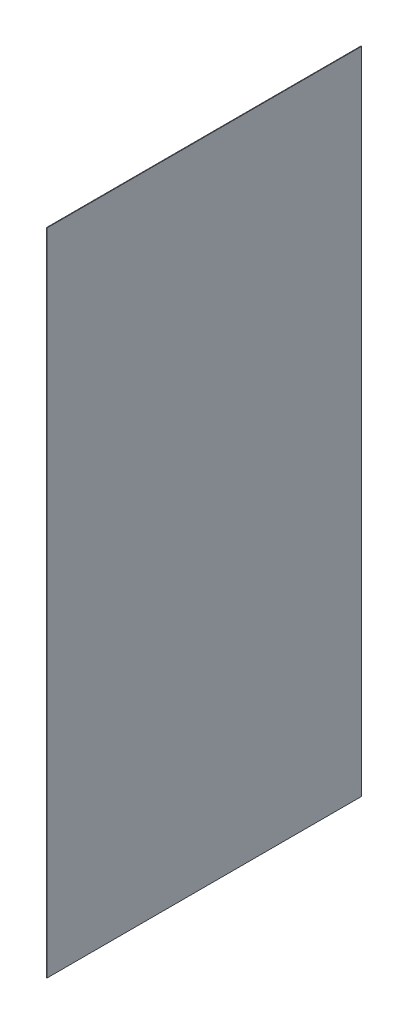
ISO-10303-21;
HEADER;
FILE_DESCRIPTION(('STEP AP214'),'2;1');
FILE_NAME('part.step','',(''),(''),'','','');
FILE_SCHEMA(('AUTOMOTIVE_DESIGN { 1 0 10303 214 1 1 1 1 }'));
ENDSEC;
DATA;
#1=APPLICATION_CONTEXT('core data for automotive mechanical design processes');
#2=APPLICATION_PROTOCOL_DEFINITION('international standard','automotive_design',2000,#1);
#3=PRODUCT_CONTEXT('',#1,'mechanical');
#4=PRODUCT('Part','Part','',(#3));
#5=PRODUCT_RELATED_PRODUCT_CATEGORY('part','',(#4));
#6=PRODUCT_DEFINITION_FORMATION('','',#4);
#7=PRODUCT_DEFINITION_CONTEXT('part definition',#1,'design');
#8=PRODUCT_DEFINITION('design','',#6,#7);
#9=PRODUCT_DEFINITION_SHAPE('','',#8);
#10=(LENGTH_UNIT() NAMED_UNIT(*) SI_UNIT(.MILLI.,.METRE.));
#11=(NAMED_UNIT(*) PLANE_ANGLE_UNIT() SI_UNIT($,.RADIAN.));
#12=(NAMED_UNIT(*) SI_UNIT($,.STERADIAN.) SOLID_ANGLE_UNIT());
#13=UNCERTAINTY_MEASURE_WITH_UNIT(LENGTH_MEASURE(1.E-05),#10,'distance_accuracy_value','');
#14=(GEOMETRIC_REPRESENTATION_CONTEXT(3) GLOBAL_UNCERTAINTY_ASSIGNED_CONTEXT((#13)) GLOBAL_UNIT_ASSIGNED_CONTEXT((#10,
#11,#12)) REPRESENTATION_CONTEXT('',''));
#15=CARTESIAN_POINT('',(0.,0.,0.));
#16=DIRECTION('',(0.,0.,1.));
#17=DIRECTION('',(1.,0.,0.));
#18=AXIS2_PLACEMENT_3D('',#15,#16,#17);
#19=CARTESIAN_POINT('',(0.,3504.13943968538,-1687.98786277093));
#20=DIRECTION('',(0.,1.,0.));
#21=DIRECTION('',(0.,0.,1.));
#22=AXIS2_PLACEMENT_3D('',#19,#20,#21);
#23=PLANE('',#22);
#24=DIRECTION('',(0.,0.,1.));
#25=VECTOR('',#24,1.);
#26=CARTESIAN_POINT('',(3.175,3504.13943968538,-1687.98786277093));
#27=LINE('',#26,#25);
#28=CARTESIAN_POINT('',(3.175,3504.13943968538,-1687.98786277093));
#29=VERTEX_POINT('',#28);
#30=CARTESIAN_POINT('',(3.175,3504.13943968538,32.862137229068));
#31=VERTEX_POINT('',#30);
#32=EDGE_CURVE('E95',#29,#31,#27,.T.);
#33=ORIENTED_EDGE('',*,*,#32,.F.);
#34=DIRECTION('',(1.,0.,0.));
#35=VECTOR('',#34,1.);
#36=CARTESIAN_POINT('',(0.,3504.13943968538,-1687.98786277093));
#37=LINE('',#36,#35);
#38=CARTESIAN_POINT('',(0.,3504.13943968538,-1687.98786277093));
#39=VERTEX_POINT('',#38);
#40=EDGE_CURVE('E11',#39,#29,#37,.T.);
#41=ORIENTED_EDGE('',*,*,#40,.F.);
#42=DIRECTION('',(0.,0.,1.));
#43=VECTOR('',#42,1.);
#44=CARTESIAN_POINT('',(0.,3504.13943968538,-1687.98786277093));
#45=LINE('',#44,#43);
#46=CARTESIAN_POINT('',(0.,3504.13943968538,32.862137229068));
#47=VERTEX_POINT('',#46);
#48=EDGE_CURVE('E89',#39,#47,#45,.T.);
#49=ORIENTED_EDGE('',*,*,#48,.T.);
#50=DIRECTION('',(1.,0.,0.));
#51=VECTOR('',#50,1.);
#52=CARTESIAN_POINT('',(0.,3504.13943968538,32.862137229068));
#53=LINE('',#52,#51);
#54=EDGE_CURVE('E34',#47,#31,#53,.T.);
#55=ORIENTED_EDGE('',*,*,#54,.T.);
#56=EDGE_LOOP('',(#33,#41,#49,#55));
#57=FACE_BOUND('',#56,.T.);
#58=ADVANCED_FACE('F31',(#57),#23,.T.);
#59=CARTESIAN_POINT('',(0.,-51.8605603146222,-1687.98786277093));
#60=DIRECTION('',(0.,0.,-1.));
#61=DIRECTION('',(0.,1.,0.));
#62=AXIS2_PLACEMENT_3D('',#59,#60,#61);
#63=PLANE('',#62);
#64=DIRECTION('',(0.,1.,0.));
#65=VECTOR('',#64,1.);
#66=CARTESIAN_POINT('',(3.175,-51.8605603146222,-1687.98786277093));
#67=LINE('',#66,#65);
#68=CARTESIAN_POINT('',(3.175,-51.8605603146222,-1687.98786277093));
#69=VERTEX_POINT('',#68);
#70=EDGE_CURVE('E91',#69,#29,#67,.T.);
#71=ORIENTED_EDGE('',*,*,#70,.F.);
#72=DIRECTION('',(1.,0.,0.));
#73=VECTOR('',#72,1.);
#74=CARTESIAN_POINT('',(0.,-51.8605603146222,-1687.98786277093));
#75=LINE('',#74,#73);
#76=CARTESIAN_POINT('',(0.,-51.8605603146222,-1687.98786277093));
#77=VERTEX_POINT('',#76);
#78=EDGE_CURVE('E40',#77,#69,#75,.T.);
#79=ORIENTED_EDGE('',*,*,#78,.F.);
#80=DIRECTION('',(0.,1.,0.));
#81=VECTOR('',#80,1.);
#82=CARTESIAN_POINT('',(0.,-51.8605603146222,-1687.98786277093));
#83=LINE('',#82,#81);
#84=EDGE_CURVE('E86',#77,#39,#83,.T.);
#85=ORIENTED_EDGE('',*,*,#84,.T.);
#86=ORIENTED_EDGE('',*,*,#40,.T.);
#87=EDGE_LOOP('',(#71,#79,#85,#86));
#88=FACE_BOUND('',#87,.T.);
#89=ADVANCED_FACE('F105',(#88),#63,.T.);
#90=CARTESIAN_POINT('',(0.,-51.8605603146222,32.8621372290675));
#91=DIRECTION('',(0.,-1.,0.));
#92=DIRECTION('',(0.,0.,-1.));
#93=AXIS2_PLACEMENT_3D('',#90,#91,#92);
#94=PLANE('',#93);
#95=DIRECTION('',(0.,0.,-1.));
#96=VECTOR('',#95,1.);
#97=CARTESIAN_POINT('',(3.175,-51.8605603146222,32.8621372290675));
#98=LINE('',#97,#96);
#99=CARTESIAN_POINT('',(3.175,-51.8605603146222,32.8621372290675));
#100=VERTEX_POINT('',#99);
#101=EDGE_CURVE('E81',#100,#69,#98,.T.);
#102=ORIENTED_EDGE('',*,*,#101,.F.);
#103=DIRECTION('',(1.,0.,0.));
#104=VECTOR('',#103,1.);
#105=CARTESIAN_POINT('',(0.,-51.8605603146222,32.8621372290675));
#106=LINE('',#105,#104);
#107=CARTESIAN_POINT('',(0.,-51.8605603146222,32.8621372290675));
#108=VERTEX_POINT('',#107);
#109=EDGE_CURVE('E76',#108,#100,#106,.T.);
#110=ORIENTED_EDGE('',*,*,#109,.F.);
#111=DIRECTION('',(0.,0.,-1.));
#112=VECTOR('',#111,1.);
#113=CARTESIAN_POINT('',(0.,-51.8605603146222,32.8621372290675));
#114=LINE('',#113,#112);
#115=EDGE_CURVE('E79',#108,#77,#114,.T.);
#116=ORIENTED_EDGE('',*,*,#115,.T.);
#117=ORIENTED_EDGE('',*,*,#78,.T.);
#118=EDGE_LOOP('',(#102,#110,#116,#117));
#119=FACE_BOUND('',#118,.T.);
#120=ADVANCED_FACE('F78',(#119),#94,.T.);
#121=CARTESIAN_POINT('',(0.,3504.13943968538,32.862137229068));
#122=DIRECTION('',(0.,0.,1.));
#123=DIRECTION('',(0.,-1.,0.));
#124=AXIS2_PLACEMENT_3D('',#121,#122,#123);
#125=PLANE('',#124);
#126=DIRECTION('',(0.,-1.,0.));
#127=VECTOR('',#126,1.);
#128=CARTESIAN_POINT('',(3.175,3504.13943968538,32.862137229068));
#129=LINE('',#128,#127);
#130=EDGE_CURVE('E98',#31,#100,#129,.T.);
#131=ORIENTED_EDGE('',*,*,#130,.F.);
#132=ORIENTED_EDGE('',*,*,#54,.F.);
#133=DIRECTION('',(0.,-1.,0.));
#134=VECTOR('',#133,1.);
#135=CARTESIAN_POINT('',(0.,3504.13943968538,32.862137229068));
#136=LINE('',#135,#134);
#137=EDGE_CURVE('E85',#47,#108,#136,.T.);
#138=ORIENTED_EDGE('',*,*,#137,.T.);
#139=ORIENTED_EDGE('',*,*,#109,.T.);
#140=EDGE_LOOP('',(#131,#132,#138,#139));
#141=FACE_BOUND('',#140,.T.);
#142=ADVANCED_FACE('F88',(#141),#125,.T.);
#143=CARTESIAN_POINT('',(0.,3504.13943968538,32.862137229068));
#144=DIRECTION('',(1.,0.,0.));
#145=DIRECTION('',(0.,0.,-1.));
#146=AXIS2_PLACEMENT_3D('',#143,#144,#145);
#147=PLANE('',#146);
#148=ORIENTED_EDGE('',*,*,#48,.F.);
#149=ORIENTED_EDGE('',*,*,#84,.F.);
#150=ORIENTED_EDGE('',*,*,#115,.F.);
#151=ORIENTED_EDGE('',*,*,#137,.F.);
#152=EDGE_LOOP('',(#148,#149,#150,#151));
#153=FACE_BOUND('',#152,.T.);
#154=ADVANCED_FACE('F84',(#153),#147,.F.);
#155=CARTESIAN_POINT('',(3.175,3504.13943968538,32.862137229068));
#156=DIRECTION('',(1.,0.,0.));
#157=DIRECTION('',(0.,0.,-1.));
#158=AXIS2_PLACEMENT_3D('',#155,#156,#157);
#159=PLANE('',#158);
#160=ORIENTED_EDGE('',*,*,#32,.T.);
#161=ORIENTED_EDGE('',*,*,#130,.T.);
#162=ORIENTED_EDGE('',*,*,#101,.T.);
#163=ORIENTED_EDGE('',*,*,#70,.T.);
#164=EDGE_LOOP('',(#160,#161,#162,#163));
#165=FACE_BOUND('',#164,.T.);
#166=ADVANCED_FACE('F104',(#165),#159,.T.);
#167=CLOSED_SHELL('',(#58,#89,#120,#142,#154,#166));
#168=MANIFOLD_SOLID_BREP('B2',#167);
#169=ADVANCED_BREP_SHAPE_REPRESENTATION('',(#18,#168),#14);
#170=SHAPE_DEFINITION_REPRESENTATION(#9,#169);
ENDSEC;
END-ISO-10303-21;
